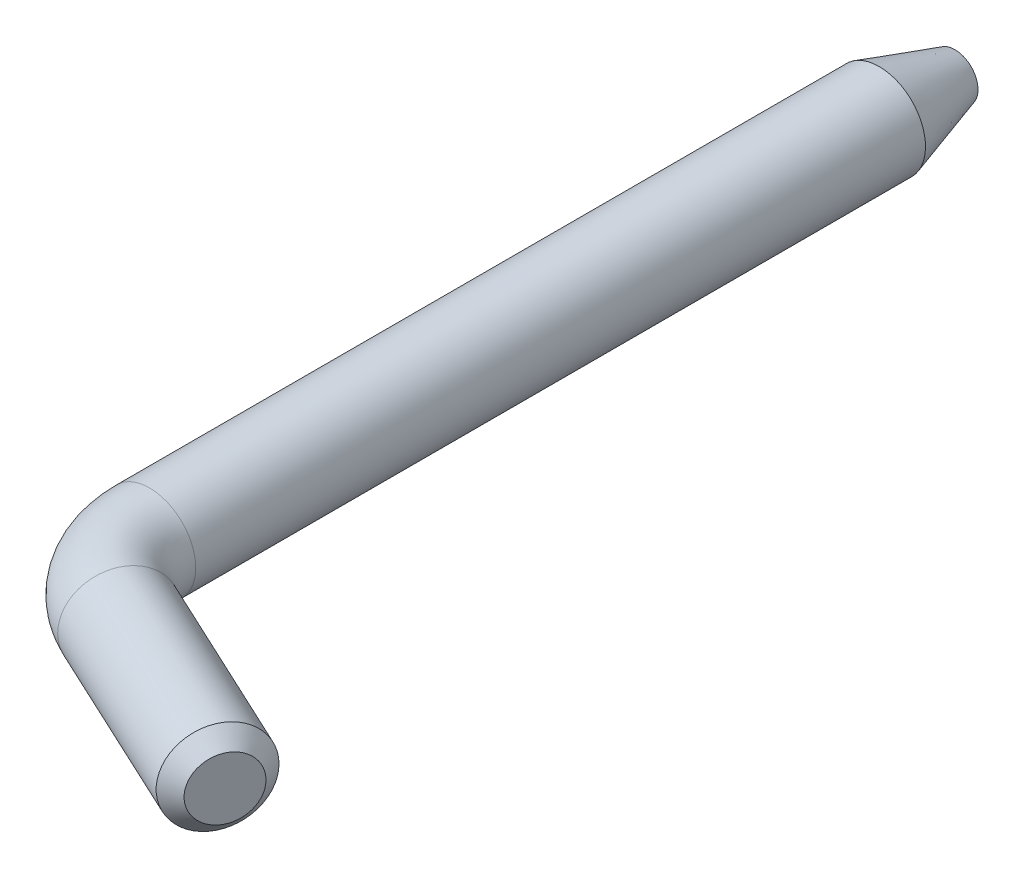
ISO-10303-21;
HEADER;
FILE_DESCRIPTION(('STEP AP214'),'2;1');
FILE_NAME('part.step','',(''),(''),'','','');
FILE_SCHEMA(('AUTOMOTIVE_DESIGN { 1 0 10303 214 1 1 1 1 }'));
ENDSEC;
DATA;
#1=APPLICATION_CONTEXT('core data for automotive mechanical design processes');
#2=APPLICATION_PROTOCOL_DEFINITION('international standard','automotive_design',2000,#1);
#3=PRODUCT_CONTEXT('',#1,'mechanical');
#4=PRODUCT('Part','Part','',(#3));
#5=PRODUCT_RELATED_PRODUCT_CATEGORY('part','',(#4));
#6=PRODUCT_DEFINITION_FORMATION('','',#4);
#7=PRODUCT_DEFINITION_CONTEXT('part definition',#1,'design');
#8=PRODUCT_DEFINITION('design','',#6,#7);
#9=PRODUCT_DEFINITION_SHAPE('','',#8);
#10=(LENGTH_UNIT() NAMED_UNIT(*) SI_UNIT(.MILLI.,.METRE.));
#11=(NAMED_UNIT(*) PLANE_ANGLE_UNIT() SI_UNIT($,.RADIAN.));
#12=(NAMED_UNIT(*) SI_UNIT($,.STERADIAN.) SOLID_ANGLE_UNIT());
#13=UNCERTAINTY_MEASURE_WITH_UNIT(LENGTH_MEASURE(1.E-05),#10,'distance_accuracy_value','');
#14=(GEOMETRIC_REPRESENTATION_CONTEXT(3) GLOBAL_UNCERTAINTY_ASSIGNED_CONTEXT((#13)) GLOBAL_UNIT_ASSIGNED_CONTEXT((#10,
#11,#12)) REPRESENTATION_CONTEXT('',''));
#15=CARTESIAN_POINT('',(0.,0.,0.));
#16=DIRECTION('',(0.,0.,1.));
#17=DIRECTION('',(1.,0.,0.));
#18=AXIS2_PLACEMENT_3D('',#15,#16,#17);
#19=CARTESIAN_POINT('',(3.46429042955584,0.,57.695425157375));
#20=DIRECTION('',(0.906307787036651,0.,0.422618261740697));
#21=DIRECTION('',(0.422618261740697,0.,-0.906307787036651));
#22=AXIS2_PLACEMENT_3D('',#19,#20,#21);
#23=CYLINDRICAL_SURFACE('',#22,3.);
#24=CARTESIAN_POINT('',(15.4348349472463,0.,63.2773817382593));
#25=DIRECTION('',(0.906307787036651,0.,0.422618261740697));
#26=DIRECTION('',(0.422618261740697,0.,-0.906307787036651));
#27=AXIS2_PLACEMENT_3D('',#24,#25,#26);
#28=CIRCLE('',#27,3.);
#29=CARTESIAN_POINT('',(16.7026897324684,0.,60.5584583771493));
#30=VERTEX_POINT('',#29);
#31=EDGE_CURVE('E8',#30,#30,#28,.F.);
#32=ORIENTED_EDGE('',*,*,#31,.T.);
#33=EDGE_LOOP('',(#32));
#34=FACE_BOUND('',#33,.T.);
#35=CARTESIAN_POINT('',(3.46429042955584,0.,57.695425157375));
#36=DIRECTION('',(0.906307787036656,0.,0.422618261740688));
#37=DIRECTION('',(0.,1.,0.));
#38=AXIS2_PLACEMENT_3D('',#35,#36,#37);
#39=CIRCLE('',#38,3.);
#40=CARTESIAN_POINT('',(2.19643564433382,0.,60.4143485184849));
#41=VERTEX_POINT('',#40);
#42=EDGE_CURVE('E31',#41,#41,#39,.T.);
#43=ORIENTED_EDGE('',*,*,#42,.T.);
#44=EDGE_LOOP('',(#43));
#45=FACE_BOUND('',#44,.T.);
#46=ADVANCED_FACE('F12',(#34,#45),#23,.T.);
#47=CARTESIAN_POINT('',(6.,0.,52.257578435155));
#48=DIRECTION('',(0.,1.,0.));
#49=DIRECTION('',(-1.,0.,0.));
#50=AXIS2_PLACEMENT_3D('',#47,#48,#49);
#51=TOROIDAL_SURFACE('',#50,6.,3.);
#52=CARTESIAN_POINT('',(0.,0.,52.257578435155));
#53=DIRECTION('',(0.,0.,1.));
#54=DIRECTION('',(0.,1.,0.));
#55=AXIS2_PLACEMENT_3D('',#52,#53,#54);
#56=CIRCLE('',#55,3.);
#57=CARTESIAN_POINT('',(-3.,0.,52.257578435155));
#58=VERTEX_POINT('',#57);
#59=EDGE_CURVE('E34',#58,#58,#56,.T.);
#60=CARTESIAN_POINT('',(6.,0.,52.257578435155));
#61=DIRECTION('',(0.,1.,0.));
#62=DIRECTION('',(-1.,0.,0.));
#63=AXIS2_PLACEMENT_3D('',#60,#61,#62);
#64=CIRCLE('',#63,9.);
#65=EDGE_CURVE('',#58,#41,#64,.T.);
#66=ORIENTED_EDGE('',*,*,#59,.T.);
#67=ORIENTED_EDGE('',*,*,#42,.F.);
#68=ORIENTED_EDGE('',*,*,#65,.T.);
#69=ORIENTED_EDGE('',*,*,#65,.F.);
#70=EDGE_LOOP('',(#66,#68,#67,#69));
#71=FACE_BOUND('',#70,.T.);
#72=ADVANCED_FACE('F38',(#71),#51,.T.);
#73=CARTESIAN_POINT('',(0.,0.,52.257578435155));
#74=DIRECTION('',(0.,0.,-1.));
#75=DIRECTION('',(0.,-1.,0.));
#76=AXIS2_PLACEMENT_3D('',#73,#74,#75);
#77=CYLINDRICAL_SURFACE('',#76,3.);
#78=CARTESIAN_POINT('',(0.,0.,4.90627892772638));
#79=DIRECTION('',(0.,0.,1.));
#80=DIRECTION('',(0.,1.,0.));
#81=AXIS2_PLACEMENT_3D('',#78,#79,#80);
#82=CIRCLE('',#81,3.);
#83=CARTESIAN_POINT('',(0.,3.,4.90627892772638));
#84=VERTEX_POINT('',#83);
#85=EDGE_CURVE('E26',#84,#84,#82,.T.);
#86=ORIENTED_EDGE('',*,*,#85,.T.);
#87=EDGE_LOOP('',(#86));
#88=FACE_BOUND('',#87,.T.);
#89=ORIENTED_EDGE('',*,*,#59,.F.);
#90=EDGE_LOOP('',(#89));
#91=FACE_BOUND('',#90,.T.);
#92=ADVANCED_FACE('F41',(#88,#91),#77,.T.);
#93=CARTESIAN_POINT('',(16.341142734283,0.,63.7));
#94=DIRECTION('',(0.906307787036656,0.,0.422618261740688));
#95=DIRECTION('',(0.,1.,0.));
#96=AXIS2_PLACEMENT_3D('',#93,#94,#95);
#97=PLANE('',#96);
#98=CARTESIAN_POINT('',(16.341142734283,0.,63.7));
#99=DIRECTION('',(0.906307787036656,0.,0.422618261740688));
#100=DIRECTION('',(0.422618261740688,0.,-0.906307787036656));
#101=AXIS2_PLACEMENT_3D('',#98,#99,#100);
#102=CIRCLE('',#101,2.);
#103=CARTESIAN_POINT('',(17.1863792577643,0.,61.8873844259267));
#104=VERTEX_POINT('',#103);
#105=EDGE_CURVE('E18',#104,#104,#102,.T.);
#106=ORIENTED_EDGE('',*,*,#105,.T.);
#107=EDGE_LOOP('',(#106));
#108=FACE_BOUND('',#107,.T.);
#109=ADVANCED_FACE('F43',(#108),#97,.T.);
#110=CARTESIAN_POINT('',(0.,0.,0.));
#111=DIRECTION('',(0.,0.,1.));
#112=DIRECTION('',(0.,1.,0.));
#113=AXIS2_PLACEMENT_3D('',#110,#111,#112);
#114=PLANE('',#113);
#115=CARTESIAN_POINT('',(0.,0.,0.));
#116=DIRECTION('',(0.,0.,1.));
#117=DIRECTION('',(0.,1.,0.));
#118=AXIS2_PLACEMENT_3D('',#115,#116,#117);
#119=CIRCLE('',#118,1.49999999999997);
#120=CARTESIAN_POINT('',(0.,1.49999999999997,0.));
#121=VERTEX_POINT('',#120);
#122=EDGE_CURVE('E22',#121,#121,#119,.F.);
#123=ORIENTED_EDGE('',*,*,#122,.T.);
#124=EDGE_LOOP('',(#123));
#125=FACE_BOUND('',#124,.T.);
#126=ADVANCED_FACE('F46',(#125),#114,.F.);
#127=CARTESIAN_POINT('',(0.,0.,4.90627892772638));
#128=DIRECTION('',(0.,0.,1.));
#129=DIRECTION('',(0.,1.,0.));
#130=AXIS2_PLACEMENT_3D('',#127,#128,#129);
#131=CONICAL_SURFACE('',#130,3.,0.296705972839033);
#132=ORIENTED_EDGE('',*,*,#122,.F.);
#133=EDGE_LOOP('',(#132));
#134=FACE_BOUND('',#133,.T.);
#135=ORIENTED_EDGE('',*,*,#85,.F.);
#136=EDGE_LOOP('',(#135));
#137=FACE_BOUND('',#136,.T.);
#138=ADVANCED_FACE('F55',(#134,#137),#131,.T.);
#139=CARTESIAN_POINT('',(16.341142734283,0.,63.7));
#140=DIRECTION('',(-0.906307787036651,0.,-0.422618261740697));
#141=DIRECTION('',(-0.422618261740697,0.,0.906307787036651));
#142=AXIS2_PLACEMENT_3D('',#139,#140,#141);
#143=CONICAL_SURFACE('',#142,2.,0.785398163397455);
#144=ORIENTED_EDGE('',*,*,#31,.F.);
#145=EDGE_LOOP('',(#144));
#146=FACE_BOUND('',#145,.T.);
#147=ORIENTED_EDGE('',*,*,#105,.F.);
#148=EDGE_LOOP('',(#147));
#149=FACE_BOUND('',#148,.T.);
#150=ADVANCED_FACE('F96',(#146,#149),#143,.T.);
#151=CLOSED_SHELL('',(#46,#72,#92,#109,#126,#138,#150));
#152=MANIFOLD_SOLID_BREP('B1',#151);
#153=ADVANCED_BREP_SHAPE_REPRESENTATION('',(#18,#152),#14);
#154=SHAPE_DEFINITION_REPRESENTATION(#9,#153);
ENDSEC;
END-ISO-10303-21;
